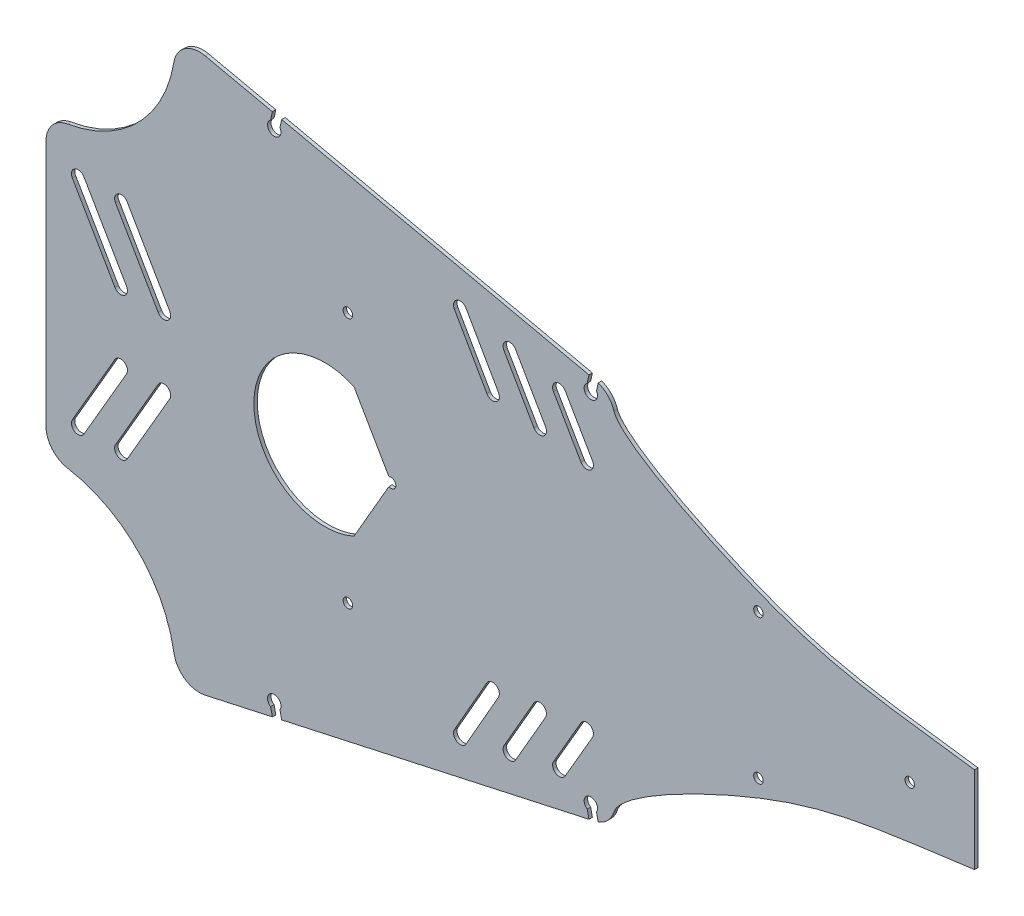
from build123d import *

# Parameters (mm, degrees)
ESQUISSE1_R             = 1.55
ESQUISSE1_R_2           = 1.1
ESQUISSE1_R_3           = 1.549999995
EXTRUSION1_DEPTH        = 0.8
ENL_V_MAT_EXTRU_1_DEPTH = 249.439861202
ENL_V_MAT_EXTRU_2_DEPTH = 249.439861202


with BuildPart() as part:
    # Esquisse1 → Extrusion1 (new body)
    with BuildSketch(Plane.XY):
        with BuildLine():
            Line((25.150523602, 28.5698389), (25.150523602, -28.5698389))
            ThreePointArc((25.150523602, -28.5698389), (26.567947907, -32.442822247), (30.150523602, -34.485918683))
            ThreePointArc((30.150523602, -34.485918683), (46.403818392, -42.893281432), (54.749627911, -59.178268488))
            ThreePointArc((54.749627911, -59.178268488), (57.304746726, -63.16843283), (61.958135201, -64.060631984))
            Line((61.958135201, -64.060631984), (152.131314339, -44.230345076))
            ThreePointArc((152.131314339, -44.230345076), (154.881503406, -42.807429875), (156.555979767, -40.202750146))
            add(Edge.make_bspline(
                [(240, -10), (216.274031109, -13.229517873), (198.784165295, -14.481909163), (158.014867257, -35.653942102), (156.555979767, -40.202750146)],
                knots=[0, 0, 0, 0, 0.573688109, 0.920874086, 0.920874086, 0.920874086, 0.920874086], degree=3))
            Line((240, -10), (240, 10))
            add(Edge.make_bspline(
                [(240, 10), (216.274031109, 13.229517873), (198.784165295, 14.481909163), (158.014867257, 35.653942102), (156.555979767, 40.202750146)],
                knots=[0, 0, 0, 0, 0.573688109, 0.920874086, 0.920874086, 0.920874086, 0.920874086], degree=3))
            ThreePointArc((156.555979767, 40.202750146), (154.881503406, 42.807429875), (152.131314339, 44.230345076))
            Line((152.131314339, 44.230345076), (61.958135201, 64.060631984))
            ThreePointArc((61.958135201, 64.060631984), (57.304746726, 63.16843283), (54.749627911, 59.178268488))
            ThreePointArc((54.749627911, 59.178268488), (46.403818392, 42.893281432), (30.150523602, 34.485918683))
            ThreePointArc((30.150523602, 34.485918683), (26.567947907, 32.442822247), (25.150523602, 28.5698389))
        make_face()
        with Locations((151.214241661, 41.36033527)):
            Circle(ESQUISSE1_R, mode=Mode.SUBTRACT)
        with Locations(Location((151.214241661, -41.36033527, 0), (0, 0, 180))):
            Circle(ESQUISSE1_R, mode=Mode.SUBTRACT)
        with Locations((225, 0)):
            Circle(ESQUISSE1_R_2, mode=Mode.SUBTRACT)
        with Locations((105, 0)):
            Circle(ESQUISSE1_R_2, mode=Mode.SUBTRACT)
        with Locations((190, 16.683070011)):
            Circle(ESQUISSE1_R_2, mode=Mode.SUBTRACT)
        with Locations((95, 29.078947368)):
            Circle(ESQUISSE1_R_2, mode=Mode.SUBTRACT)
        with Locations(Location((190, -16.683070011, 0), (0, 0, 180))):
            Circle(ESQUISSE1_R_2, mode=Mode.SUBTRACT)
        with Locations(Location((95, -29.078947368, 0), (0, 0, 180))):
            Circle(ESQUISSE1_R_2, mode=Mode.SUBTRACT)
        with Locations(Location((77.964575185, -57.468915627, 0), (0, 0, 180))):
            Circle(ESQUISSE1_R_3, mode=Mode.SUBTRACT)
        with Locations((77.964575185, 57.468915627)):
            Circle(ESQUISSE1_R_3, mode=Mode.SUBTRACT)
    extrude(amount=EXTRUSION1_DEPTH)

    # Esquisse2 → Enl_v. mat.-Extru.1 (cut, through all)
    with BuildSketch(Plane.XY.offset(0.8)):
        with BuildLine():
            Line((138.053793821, -27.554306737), (131.115952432, -39.591402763))
            ThreePointArc((131.115952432, -39.591402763), (131.6848463, -41.708325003), (133.801768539, -41.139431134))
            Line((133.801768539, -41.139431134), (140.739609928, -29.102335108))
            ThreePointArc((140.739609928, -29.102335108), (140.17071606, -26.985412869), (138.053793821, -27.554306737))
        make_face()
        with BuildLine():
            Line((148.926625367, -26.131926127), (142.581112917, -37.06660383))
            ThreePointArc((142.581112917, -37.06660383), (143.143755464, -39.185196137), (145.262347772, -38.62255359))
            Line((145.262347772, -38.62255359), (151.607860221, -27.687875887))
            ThreePointArc((151.607860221, -27.687875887), (151.045217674, -25.569283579), (148.926625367, -26.131926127))
        make_face()
        with BuildLine():
            Line((127.159525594, -28.980270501), (119.650322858, -42.117048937))
            ThreePointArc((119.650322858, -42.117048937), (120.226784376, -44.231922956), (122.341658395, -43.655461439))
            Line((122.341658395, -43.655461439), (129.850861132, -30.518683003))
            ThreePointArc((129.850861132, -30.518683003), (129.274399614, -28.403808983), (127.159525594, -28.980270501))
        make_face()
        with BuildLine():
            Line((127.159525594, 28.980270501), (119.650322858, 42.117048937))
            ThreePointArc((119.650322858, 42.117048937), (120.226784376, 44.231922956), (122.341658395, 43.655461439))
            Line((122.341658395, 43.655461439), (129.850861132, 30.518683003))
            ThreePointArc((129.850861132, 30.518683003), (129.274399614, 28.403808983), (127.159525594, 28.980270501))
        make_face()
        with BuildLine():
            Line((105.067234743, 0), (96.406980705, 15))
            ThreePointArc((96.406980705, 15), (73.235877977, 0), (96.406980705, -15))
            Line((96.406980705, -15), (105.067234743, 0))
        make_face()
        with BuildLine():
            Line((33.918422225, -25.77797488), (43.783707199, -8.77797488))
            ThreePointArc((43.783707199, -8.77797488), (43.221064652, -6.659382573), (41.102472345, -7.22202512))
            Line((41.102472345, -7.22202512), (31.237187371, -24.22202512))
            ThreePointArc((31.237187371, -24.22202512), (31.799829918, -26.340617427), (33.918422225, -25.77797488))
        make_face()
        with BuildLine():
            Line((43.918422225, -25.77797488), (53.783707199, -8.77797488))
            ThreePointArc((53.783707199, -8.77797488), (53.221064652, -6.659382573), (51.102472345, -7.22202512))
            Line((51.102472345, -7.22202512), (41.237187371, -24.22202512))
            ThreePointArc((41.237187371, -24.22202512), (41.799829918, -26.340617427), (43.918422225, -25.77797488))
        make_face()
        with BuildLine():
            Line((140.739609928, 29.102335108), (133.801768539, 41.139431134))
            ThreePointArc((133.801768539, 41.139431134), (131.6848463, 41.708325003), (131.115952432, 39.591402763))
            Line((131.115952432, 39.591402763), (138.053793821, 27.554306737))
            ThreePointArc((138.053793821, 27.554306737), (140.17071606, 26.985412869), (140.739609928, 29.102335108))
        make_face()
        with BuildLine():
            Line((148.926625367, 26.131926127), (142.581112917, 37.06660383))
            ThreePointArc((142.581112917, 37.06660383), (143.143755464, 39.185196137), (145.262347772, 38.62255359))
            Line((145.262347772, 38.62255359), (151.607860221, 27.687875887))
            ThreePointArc((151.607860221, 27.687875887), (151.045217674, 25.569283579), (148.926625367, 26.131926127))
        make_face()
        with BuildLine():
            Line((33.918422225, 25.77797488), (43.783707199, 8.77797488))
            ThreePointArc((43.783707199, 8.77797488), (43.221064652, 6.659382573), (41.102472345, 7.22202512))
            Line((41.102472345, 7.22202512), (31.237187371, 24.22202512))
            ThreePointArc((31.237187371, 24.22202512), (31.799829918, 26.340617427), (33.918422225, 25.77797488))
        make_face()
        with BuildLine():
            Line((43.918422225, 25.77797488), (53.783707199, 8.77797488))
            ThreePointArc((53.783707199, 8.77797488), (53.221064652, 6.659382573), (51.102472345, 7.22202512))
            Line((51.102472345, 7.22202512), (41.237187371, 24.22202512))
            ThreePointArc((41.237187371, 24.22202512), (41.799829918, 26.340617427), (43.918422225, 25.77797488))
        make_face()
    extrude(amount=-ENL_V_MAT_EXTRU_1_DEPTH, mode=Mode.SUBTRACT)

    # Esquisse3 → Enl_v. mat.-Extru.2 (cut, through all)
    with BuildSketch(Plane.XY.offset(0.8)):
        Polygon((150.139913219, 41.596594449), (152.288570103, 41.124076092), (155.034832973, 53.612007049), (152.88617609, 54.084525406), align=None)
        Polygon((79.038903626, 57.232656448), (81.393043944, 67.937509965), (79.24438706, 68.410028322), (76.890246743, 57.705174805), align=None)
        Polygon((76.890246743, -57.705174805), (79.038903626, -57.232656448), (81.393043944, -67.937509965), (79.24438706, -68.410028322), align=None)
        Polygon((150.139913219, -41.596594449), (152.88617609, -54.084525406), (155.034832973, -53.612007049), (152.288570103, -41.124076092), align=None)
    extrude(amount=-ENL_V_MAT_EXTRU_2_DEPTH, mode=Mode.SUBTRACT)


solid = part.part
